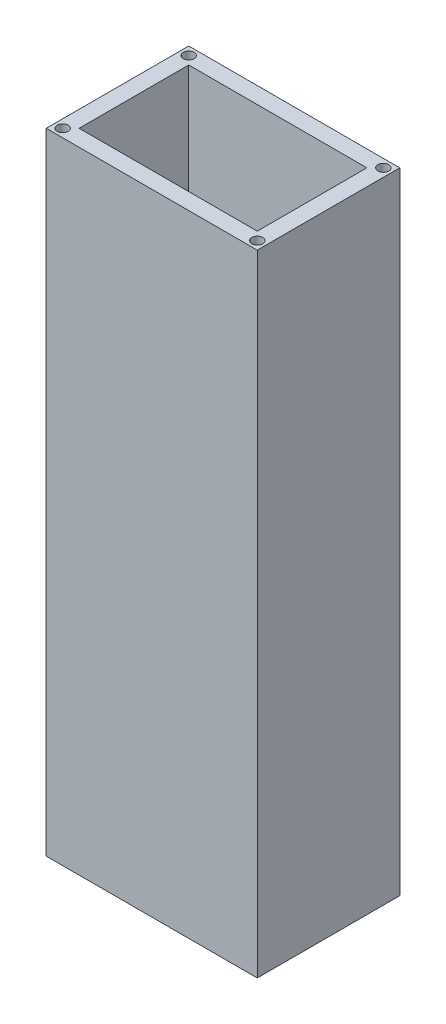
from build123d import *

# Parameters (mm, degrees)
CROQUIS1_W              = 77
CROQUIS1_H              = 52
CROQUIS1_R              = 2
CROQUIS1_W_2            = 65
CROQUIS1_H_2            = 40
SALIENTE_EXTRUIR1_DEPTH = 230
CROQUIS4_W              = 30
CROQUIS4_H              = 30
CORTAR_EXTRUIR2_DEPTH   = 235.644944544


with BuildPart() as part:
    # Croquis1 → Saliente-Extruir1 (new body)
    with BuildSketch(Plane(origin=(0, 0, 0), x_dir=(1, 0, 0), z_dir=(0, 1, 0))):
        Rectangle(CROQUIS1_W, CROQUIS1_H)
        with Locations(Location((35.5, 23, 0), (0, 0, 270))):
            Circle(CROQUIS1_R, mode=Mode.SUBTRACT)
        with Locations(Location((35.5, -23, 0), (0, 0, 90))):
            Circle(CROQUIS1_R, mode=Mode.SUBTRACT)
        with Locations(Location((-35.5, -23, 0), (0, 0, 270))):
            Circle(CROQUIS1_R, mode=Mode.SUBTRACT)
        with Locations(Location((-35.5, 23, 0), (0, 0, 90))):
            Circle(CROQUIS1_R, mode=Mode.SUBTRACT)
        Rectangle(CROQUIS1_W_2, CROQUIS1_H_2, mode=Mode.SUBTRACT)
    extrude(amount=SALIENTE_EXTRUIR1_DEPTH)

    # Croquis4 → Cortar-Extruir2 (cut, through all)
    with BuildSketch(Plane.XY):
        with Locations((0, 70)):
            Rectangle(CROQUIS4_W, CROQUIS4_H)
    extrude(amount=-CORTAR_EXTRUIR2_DEPTH, mode=Mode.SUBTRACT)


solid = part.part
